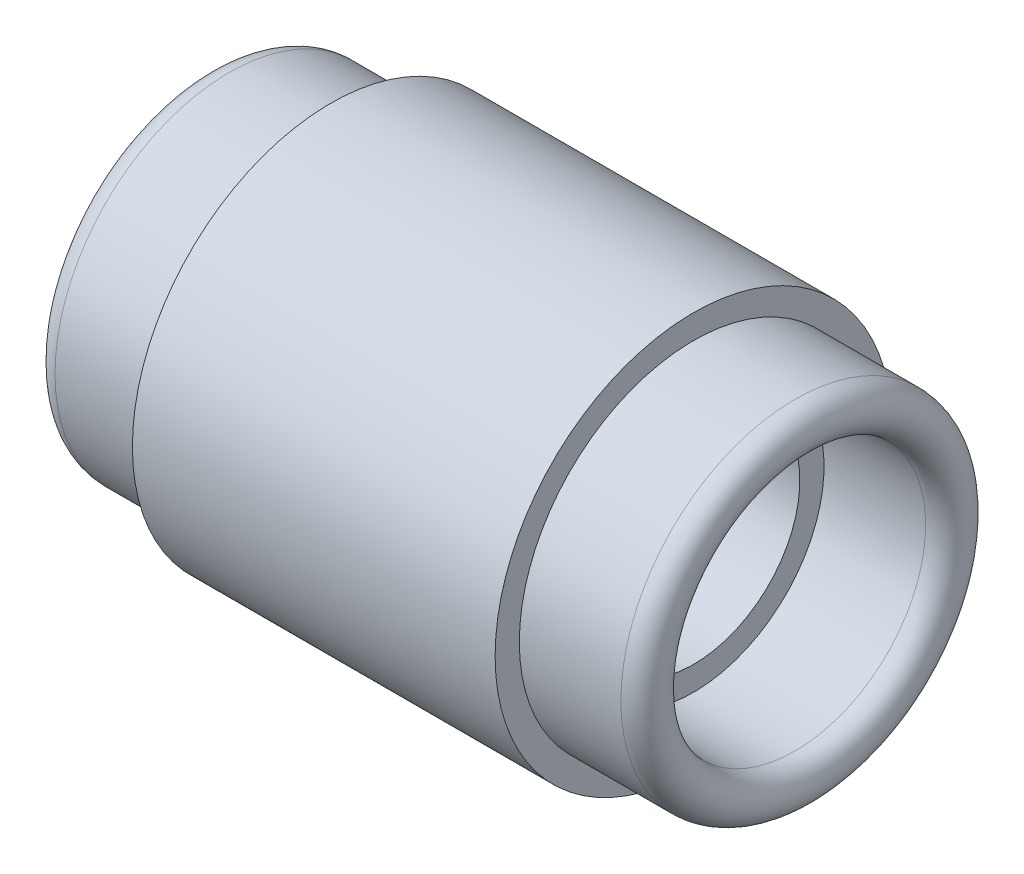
ISO-10303-21;
HEADER;
FILE_DESCRIPTION(('STEP AP214'),'2;1');
FILE_NAME('part.step','',(''),(''),'','','');
FILE_SCHEMA(('AUTOMOTIVE_DESIGN { 1 0 10303 214 1 1 1 1 }'));
ENDSEC;
DATA;
#1=APPLICATION_CONTEXT('core data for automotive mechanical design processes');
#2=APPLICATION_PROTOCOL_DEFINITION('international standard','automotive_design',2000,#1);
#3=PRODUCT_CONTEXT('',#1,'mechanical');
#4=PRODUCT('Part','Part','',(#3));
#5=PRODUCT_RELATED_PRODUCT_CATEGORY('part','',(#4));
#6=PRODUCT_DEFINITION_FORMATION('','',#4);
#7=PRODUCT_DEFINITION_CONTEXT('part definition',#1,'design');
#8=PRODUCT_DEFINITION('design','',#6,#7);
#9=PRODUCT_DEFINITION_SHAPE('','',#8);
#10=(LENGTH_UNIT() NAMED_UNIT(*) SI_UNIT(.MILLI.,.METRE.));
#11=(NAMED_UNIT(*) PLANE_ANGLE_UNIT() SI_UNIT($,.RADIAN.));
#12=(NAMED_UNIT(*) SI_UNIT($,.STERADIAN.) SOLID_ANGLE_UNIT());
#13=UNCERTAINTY_MEASURE_WITH_UNIT(LENGTH_MEASURE(1.E-05),#10,'distance_accuracy_value','');
#14=(GEOMETRIC_REPRESENTATION_CONTEXT(3) GLOBAL_UNCERTAINTY_ASSIGNED_CONTEXT((#13)) GLOBAL_UNIT_ASSIGNED_CONTEXT((#10,
#11,#12)) REPRESENTATION_CONTEXT('',''));
#15=CARTESIAN_POINT('',(0.,0.,0.));
#16=DIRECTION('',(0.,0.,1.));
#17=DIRECTION('',(1.,0.,0.));
#18=AXIS2_PLACEMENT_3D('',#15,#16,#17);
#19=CARTESIAN_POINT('',(-37.5,36.,0.));
#20=DIRECTION('',(1.,0.,0.));
#21=DIRECTION('',(0.,0.,-1.));
#22=AXIS2_PLACEMENT_3D('',#19,#20,#21);
#23=PLANE('',#22);
#24=CARTESIAN_POINT('',(-37.5,0.,0.));
#25=DIRECTION('',(-1.,0.,0.));
#26=DIRECTION('',(0.,0.,1.));
#27=AXIS2_PLACEMENT_3D('',#24,#25,#26);
#28=CIRCLE('',#27,36.);
#29=CARTESIAN_POINT('',(-37.5,0.,36.));
#30=VERTEX_POINT('',#29);
#31=EDGE_CURVE('E55',#30,#30,#28,.T.);
#32=ORIENTED_EDGE('',*,*,#31,.F.);
#33=EDGE_LOOP('',(#32));
#34=FACE_BOUND('',#33,.T.);
#35=CARTESIAN_POINT('',(-37.5,0.,0.));
#36=DIRECTION('',(-1.,0.,0.));
#37=DIRECTION('',(0.,0.,1.));
#38=AXIS2_PLACEMENT_3D('',#35,#36,#37);
#39=CIRCLE('',#38,41.);
#40=CARTESIAN_POINT('',(-37.5,0.,41.));
#41=VERTEX_POINT('',#40);
#42=EDGE_CURVE('E10',#41,#41,#39,.T.);
#43=ORIENTED_EDGE('',*,*,#42,.T.);
#44=EDGE_LOOP('',(#43));
#45=FACE_BOUND('',#44,.T.);
#46=ADVANCED_FACE('F15',(#34,#45),#23,.F.);
#47=CARTESIAN_POINT('',(-110.,0.,0.));
#48=DIRECTION('',(-1.,0.,0.));
#49=DIRECTION('',(0.,0.,1.));
#50=AXIS2_PLACEMENT_3D('',#47,#48,#49);
#51=CYLINDRICAL_SURFACE('',#50,41.);
#52=ORIENTED_EDGE('',*,*,#42,.F.);
#53=EDGE_LOOP('',(#52));
#54=FACE_BOUND('',#53,.T.);
#55=CARTESIAN_POINT('',(37.5,0.,0.));
#56=DIRECTION('',(-1.,0.,0.));
#57=DIRECTION('',(0.,0.,1.));
#58=AXIS2_PLACEMENT_3D('',#55,#56,#57);
#59=CIRCLE('',#58,41.);
#60=CARTESIAN_POINT('',(37.5,0.,41.));
#61=VERTEX_POINT('',#60);
#62=EDGE_CURVE('E21',#61,#61,#59,.T.);
#63=ORIENTED_EDGE('',*,*,#62,.T.);
#64=EDGE_LOOP('',(#63));
#65=FACE_BOUND('',#64,.T.);
#66=ADVANCED_FACE('F62',(#54,#65),#51,.T.);
#67=CARTESIAN_POINT('',(37.5,36.,0.));
#68=DIRECTION('',(-1.,0.,0.));
#69=DIRECTION('',(0.,0.,1.));
#70=AXIS2_PLACEMENT_3D('',#67,#68,#69);
#71=PLANE('',#70);
#72=ORIENTED_EDGE('',*,*,#62,.F.);
#73=EDGE_LOOP('',(#72));
#74=FACE_BOUND('',#73,.T.);
#75=CARTESIAN_POINT('',(37.5,0.,0.));
#76=DIRECTION('',(-1.,0.,0.));
#77=DIRECTION('',(0.,0.,1.));
#78=AXIS2_PLACEMENT_3D('',#75,#76,#77);
#79=CIRCLE('',#78,36.);
#80=CARTESIAN_POINT('',(37.5,0.,36.));
#81=VERTEX_POINT('',#80);
#82=EDGE_CURVE('E25',#81,#81,#79,.T.);
#83=ORIENTED_EDGE('',*,*,#82,.T.);
#84=EDGE_LOOP('',(#83));
#85=FACE_BOUND('',#84,.T.);
#86=ADVANCED_FACE('F67',(#74,#85),#71,.F.);
#87=CARTESIAN_POINT('',(-110.,0.,0.));
#88=DIRECTION('',(-1.,0.,0.));
#89=DIRECTION('',(0.,0.,1.));
#90=AXIS2_PLACEMENT_3D('',#87,#88,#89);
#91=CYLINDRICAL_SURFACE('',#90,36.);
#92=ORIENTED_EDGE('',*,*,#82,.F.);
#93=EDGE_LOOP('',(#92));
#94=FACE_BOUND('',#93,.T.);
#95=CARTESIAN_POINT('',(58.5,0.,0.));
#96=DIRECTION('',(-1.,0.,0.));
#97=DIRECTION('',(0.,0.,1.));
#98=AXIS2_PLACEMENT_3D('',#95,#96,#97);
#99=CIRCLE('',#98,36.);
#100=CARTESIAN_POINT('',(58.5,0.,36.));
#101=VERTEX_POINT('',#100);
#102=EDGE_CURVE('E29',#101,#101,#99,.T.);
#103=ORIENTED_EDGE('',*,*,#102,.T.);
#104=EDGE_LOOP('',(#103));
#105=FACE_BOUND('',#104,.T.);
#106=ADVANCED_FACE('F72',(#94,#105),#91,.T.);
#107=CARTESIAN_POINT('',(58.5,0.,0.));
#108=DIRECTION('',(-1.,0.,0.));
#109=DIRECTION('',(0.,0.,1.));
#110=AXIS2_PLACEMENT_3D('',#107,#108,#109);
#111=TOROIDAL_SURFACE('',#110,31.5,4.5);
#112=ORIENTED_EDGE('',*,*,#102,.F.);
#113=EDGE_LOOP('',(#112));
#114=FACE_BOUND('',#113,.T.);
#115=CARTESIAN_POINT('',(58.5,0.,0.));
#116=DIRECTION('',(-1.,0.,0.));
#117=DIRECTION('',(0.,0.,1.));
#118=AXIS2_PLACEMENT_3D('',#115,#116,#117);
#119=CIRCLE('',#118,27.);
#120=CARTESIAN_POINT('',(58.5,0.,27.));
#121=VERTEX_POINT('',#120);
#122=EDGE_CURVE('E34',#121,#121,#119,.T.);
#123=ORIENTED_EDGE('',*,*,#122,.T.);
#124=EDGE_LOOP('',(#123));
#125=FACE_BOUND('',#124,.T.);
#126=ADVANCED_FACE('F78',(#114,#125),#111,.T.);
#127=CARTESIAN_POINT('',(-110.,0.,0.));
#128=DIRECTION('',(-1.,0.,0.));
#129=DIRECTION('',(0.,0.,1.));
#130=AXIS2_PLACEMENT_3D('',#127,#128,#129);
#131=CYLINDRICAL_SURFACE('',#130,27.);
#132=ORIENTED_EDGE('',*,*,#122,.F.);
#133=EDGE_LOOP('',(#132));
#134=FACE_BOUND('',#133,.T.);
#135=CARTESIAN_POINT('',(37.5,0.,0.));
#136=DIRECTION('',(-1.,0.,0.));
#137=DIRECTION('',(0.,0.,1.));
#138=AXIS2_PLACEMENT_3D('',#135,#136,#137);
#139=CIRCLE('',#138,27.);
#140=CARTESIAN_POINT('',(37.5,0.,27.));
#141=VERTEX_POINT('',#140);
#142=EDGE_CURVE('E37',#141,#141,#139,.T.);
#143=ORIENTED_EDGE('',*,*,#142,.T.);
#144=EDGE_LOOP('',(#143));
#145=FACE_BOUND('',#144,.T.);
#146=ADVANCED_FACE('F82',(#134,#145),#131,.F.);
#147=CARTESIAN_POINT('',(37.5,27.,0.));
#148=DIRECTION('',(-1.,0.,0.));
#149=DIRECTION('',(0.,0.,1.));
#150=AXIS2_PLACEMENT_3D('',#147,#148,#149);
#151=PLANE('',#150);
#152=ORIENTED_EDGE('',*,*,#142,.F.);
#153=EDGE_LOOP('',(#152));
#154=FACE_BOUND('',#153,.T.);
#155=CARTESIAN_POINT('',(37.5,0.,0.));
#156=DIRECTION('',(-1.,0.,0.));
#157=DIRECTION('',(0.,0.,1.));
#158=AXIS2_PLACEMENT_3D('',#155,#156,#157);
#159=CIRCLE('',#158,22.);
#160=CARTESIAN_POINT('',(37.5,0.,22.));
#161=VERTEX_POINT('',#160);
#162=EDGE_CURVE('E40',#161,#161,#159,.T.);
#163=ORIENTED_EDGE('',*,*,#162,.T.);
#164=EDGE_LOOP('',(#163));
#165=FACE_BOUND('',#164,.T.);
#166=ADVANCED_FACE('F86',(#154,#165),#151,.F.);
#167=CARTESIAN_POINT('',(-110.,0.,0.));
#168=DIRECTION('',(-1.,0.,0.));
#169=DIRECTION('',(0.,0.,1.));
#170=AXIS2_PLACEMENT_3D('',#167,#168,#169);
#171=CYLINDRICAL_SURFACE('',#170,22.);
#172=ORIENTED_EDGE('',*,*,#162,.F.);
#173=EDGE_LOOP('',(#172));
#174=FACE_BOUND('',#173,.T.);
#175=CARTESIAN_POINT('',(-37.5,0.,0.));
#176=DIRECTION('',(-1.,0.,0.));
#177=DIRECTION('',(0.,0.,1.));
#178=AXIS2_PLACEMENT_3D('',#175,#176,#177);
#179=CIRCLE('',#178,22.);
#180=CARTESIAN_POINT('',(-37.5,0.,22.));
#181=VERTEX_POINT('',#180);
#182=EDGE_CURVE('E43',#181,#181,#179,.T.);
#183=ORIENTED_EDGE('',*,*,#182,.T.);
#184=EDGE_LOOP('',(#183));
#185=FACE_BOUND('',#184,.T.);
#186=ADVANCED_FACE('F90',(#174,#185),#171,.F.);
#187=CARTESIAN_POINT('',(-37.5,27.,0.));
#188=DIRECTION('',(1.,0.,0.));
#189=DIRECTION('',(0.,0.,-1.));
#190=AXIS2_PLACEMENT_3D('',#187,#188,#189);
#191=PLANE('',#190);
#192=ORIENTED_EDGE('',*,*,#182,.F.);
#193=EDGE_LOOP('',(#192));
#194=FACE_BOUND('',#193,.T.);
#195=CARTESIAN_POINT('',(-37.5,0.,0.));
#196=DIRECTION('',(-1.,0.,0.));
#197=DIRECTION('',(0.,0.,1.));
#198=AXIS2_PLACEMENT_3D('',#195,#196,#197);
#199=CIRCLE('',#198,27.);
#200=CARTESIAN_POINT('',(-37.5,0.,27.));
#201=VERTEX_POINT('',#200);
#202=EDGE_CURVE('E46',#201,#201,#199,.T.);
#203=ORIENTED_EDGE('',*,*,#202,.T.);
#204=EDGE_LOOP('',(#203));
#205=FACE_BOUND('',#204,.T.);
#206=ADVANCED_FACE('F94',(#194,#205),#191,.F.);
#207=CARTESIAN_POINT('',(-110.,0.,0.));
#208=DIRECTION('',(-1.,0.,0.));
#209=DIRECTION('',(0.,0.,1.));
#210=AXIS2_PLACEMENT_3D('',#207,#208,#209);
#211=CYLINDRICAL_SURFACE('',#210,27.);
#212=ORIENTED_EDGE('',*,*,#202,.F.);
#213=EDGE_LOOP('',(#212));
#214=FACE_BOUND('',#213,.T.);
#215=CARTESIAN_POINT('',(-58.5,0.,0.));
#216=DIRECTION('',(-1.,0.,0.));
#217=DIRECTION('',(0.,0.,1.));
#218=AXIS2_PLACEMENT_3D('',#215,#216,#217);
#219=CIRCLE('',#218,27.);
#220=CARTESIAN_POINT('',(-58.5,0.,27.));
#221=VERTEX_POINT('',#220);
#222=EDGE_CURVE('E49',#221,#221,#219,.T.);
#223=ORIENTED_EDGE('',*,*,#222,.T.);
#224=EDGE_LOOP('',(#223));
#225=FACE_BOUND('',#224,.T.);
#226=ADVANCED_FACE('F98',(#214,#225),#211,.F.);
#227=CARTESIAN_POINT('',(-58.5,0.,0.));
#228=DIRECTION('',(-1.,0.,0.));
#229=DIRECTION('',(0.,0.,1.));
#230=AXIS2_PLACEMENT_3D('',#227,#228,#229);
#231=TOROIDAL_SURFACE('',#230,31.5,4.5);
#232=ORIENTED_EDGE('',*,*,#222,.F.);
#233=EDGE_LOOP('',(#232));
#234=FACE_BOUND('',#233,.T.);
#235=CARTESIAN_POINT('',(-58.5,0.,0.));
#236=DIRECTION('',(-1.,0.,0.));
#237=DIRECTION('',(0.,0.,1.));
#238=AXIS2_PLACEMENT_3D('',#235,#236,#237);
#239=CIRCLE('',#238,36.);
#240=CARTESIAN_POINT('',(-58.5,0.,36.));
#241=VERTEX_POINT('',#240);
#242=EDGE_CURVE('E52',#241,#241,#239,.T.);
#243=ORIENTED_EDGE('',*,*,#242,.T.);
#244=EDGE_LOOP('',(#243));
#245=FACE_BOUND('',#244,.T.);
#246=ADVANCED_FACE('F102',(#234,#245),#231,.T.);
#247=CARTESIAN_POINT('',(-110.,0.,0.));
#248=DIRECTION('',(-1.,0.,0.));
#249=DIRECTION('',(0.,0.,1.));
#250=AXIS2_PLACEMENT_3D('',#247,#248,#249);
#251=CYLINDRICAL_SURFACE('',#250,36.);
#252=ORIENTED_EDGE('',*,*,#242,.F.);
#253=EDGE_LOOP('',(#252));
#254=FACE_BOUND('',#253,.T.);
#255=ORIENTED_EDGE('',*,*,#31,.T.);
#256=EDGE_LOOP('',(#255));
#257=FACE_BOUND('',#256,.T.);
#258=ADVANCED_FACE('F59',(#254,#257),#251,.T.);
#259=CLOSED_SHELL('',(#46,#66,#86,#106,#126,#146,#166,#186,#206,#226,#246,#258));
#260=MANIFOLD_SOLID_BREP('B1',#259);
#261=ADVANCED_BREP_SHAPE_REPRESENTATION('',(#18,#260),#14);
#262=SHAPE_DEFINITION_REPRESENTATION(#9,#261);
ENDSEC;
END-ISO-10303-21;
